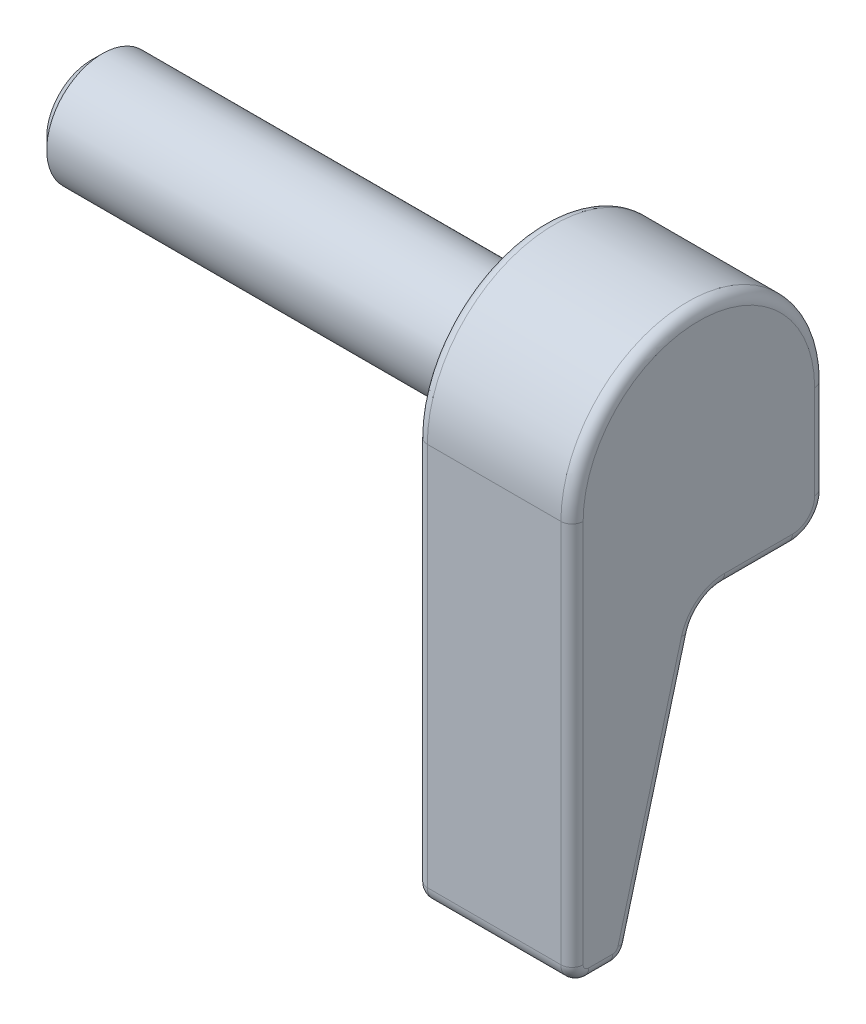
from build123d import *

# Parameters (mm, degrees)
SKETCH_1_R      = 5
EXTRUDE_1_DEPTH = 40
EXTRUDE_2_DEPTH = 14
FILLET_1_R      = 1
CHAMFER_1_SIZE  = 1
CHAMFER_2_SIZE  = 0.25


with BuildPart() as part:
    # Sketch 1 → Extrude 1 (new body)
    with BuildSketch(Plane(origin=(0, 0, 0), x_dir=(0, 0, -1), z_dir=(1, 0, 0))):
        Circle(SKETCH_1_R)
    extrude(amount=EXTRUDE_1_DEPTH)

    # Sketch 2 → Extrude 2 (add)
    with BuildSketch(Plane(origin=(40, 0, 0), x_dir=(0, 0, -1), z_dir=(1, 0, 0))):
        with BuildLine():
            Line((-9.3, -36), (-7.150608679, -36))
            ThreePointArc((-7.150608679, -36), (-6.237657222, -35.690176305), (-5.701844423, -34.888692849))
            Line((-5.701844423, -34.888692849), (0.003688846, -13.622614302))
            ThreePointArc((0.003688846, -13.622614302), (1.075314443, -12.01964739), (2.901217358, -11.4))
            Line((2.901217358, -11.4), (9, -11.4))
            ThreePointArc((9, -11.4), (11.121320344, -10.521320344), (12, -8.4))
            Line((12, -8.4), (12, 0))
            ThreePointArc((12, 0), (0.6, 11.4), (-10.8, 0))
            Line((-10.8, 0), (-10.8, -34.5))
            ThreePointArc((-10.8, -34.5), (-10.360660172, -35.560660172), (-9.3, -36))
        make_face()
    extrude(amount=EXTRUDE_2_DEPTH)

    # Fillet 1
    fillet_1_edges = [part.edges().sort_by_distance(p)[0] for p in [
        (54, -35.560660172, 10.360660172),
        (54, -36, 8.225304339),
        (54, -35.690176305, 6.237657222),
        (54, -24.255653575, 2.849077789),
        (54, -12.01964739, -1.075314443),
        (54, -11.4, -5.950608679),
        (54, -10.521320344, -11.121320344),
        (54, -4.2, -12),
        (40, 11.4, -0.6),
        (40, -17.25, 10.8),
        (40, -35.560660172, 10.360660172),
        (40, -36, 8.225304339),
        (40, -35.690176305, 6.237657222),
        (40, -24.255653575, 2.849077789),
        (40, -12.01964739, -1.075314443),
        (40, -11.4, -5.950608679),
        (40, -10.521320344, -11.121320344),
        (40, -4.2, -12),
        (54, 11.4, -0.6),
        (54, -17.25, 10.8),
    ]]
    fillet(fillet_1_edges, radius=FILLET_1_R)

    # Chamfer 1
    chamfer_1_edges = [part.edges().sort_by_distance(p)[0] for p in [
        (0, 0, 5),
    ]]
    chamfer(chamfer_1_edges, length=CHAMFER_1_SIZE)

    # Chamfer 2
    chamfer_2_edges = [part.edges().sort_by_distance(p)[0] for p in [
        (40, 0, 5),
    ]]
    chamfer(chamfer_2_edges, length=CHAMFER_2_SIZE)


solid = part.part
